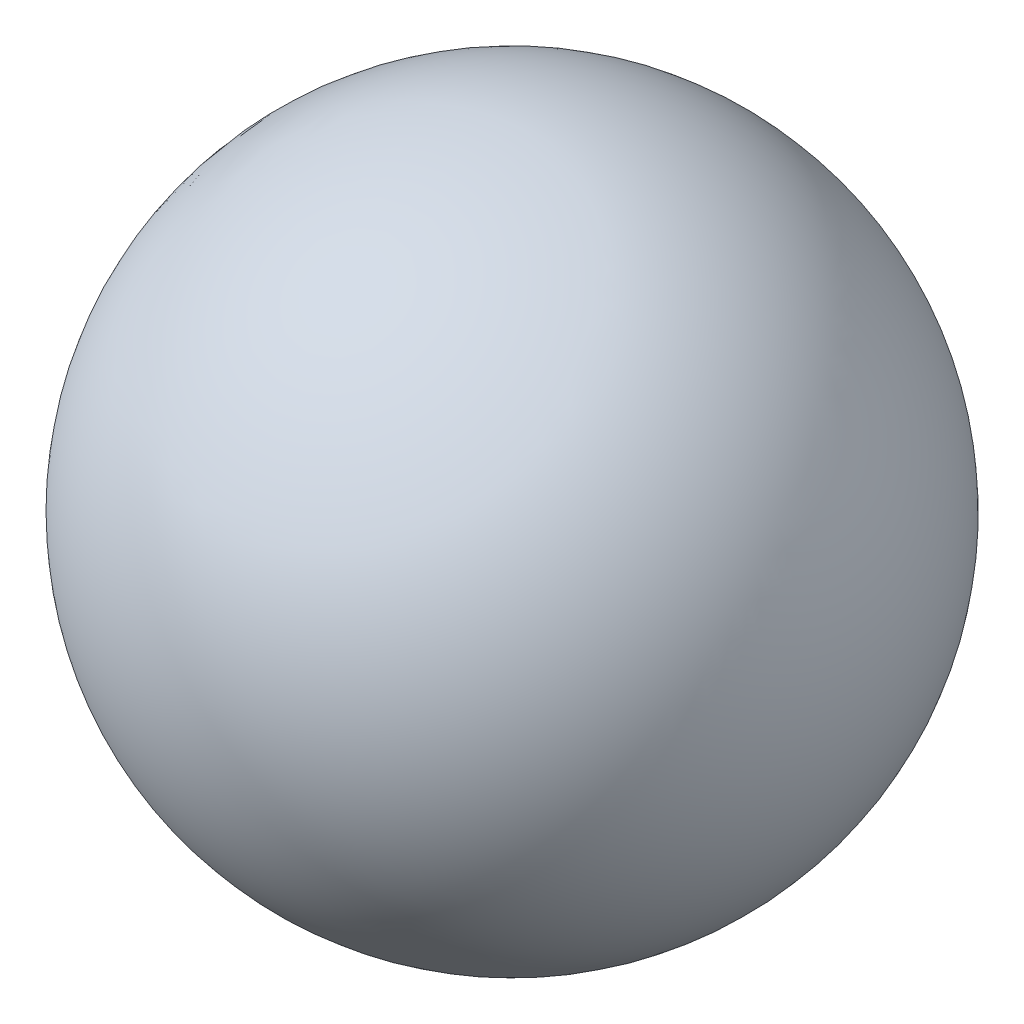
ISO-10303-21;
HEADER;
FILE_DESCRIPTION(('STEP AP214'),'2;1');
FILE_NAME('part.step','',(''),(''),'','','');
FILE_SCHEMA(('AUTOMOTIVE_DESIGN { 1 0 10303 214 1 1 1 1 }'));
ENDSEC;
DATA;
#1=APPLICATION_CONTEXT('core data for automotive mechanical design processes');
#2=APPLICATION_PROTOCOL_DEFINITION('international standard','automotive_design',2000,#1);
#3=PRODUCT_CONTEXT('',#1,'mechanical');
#4=PRODUCT('Part','Part','',(#3));
#5=PRODUCT_RELATED_PRODUCT_CATEGORY('part','',(#4));
#6=PRODUCT_DEFINITION_FORMATION('','',#4);
#7=PRODUCT_DEFINITION_CONTEXT('part definition',#1,'design');
#8=PRODUCT_DEFINITION('design','',#6,#7);
#9=PRODUCT_DEFINITION_SHAPE('','',#8);
#10=(LENGTH_UNIT() NAMED_UNIT(*) SI_UNIT(.MILLI.,.METRE.));
#11=(NAMED_UNIT(*) PLANE_ANGLE_UNIT() SI_UNIT($,.RADIAN.));
#12=(NAMED_UNIT(*) SI_UNIT($,.STERADIAN.) SOLID_ANGLE_UNIT());
#13=UNCERTAINTY_MEASURE_WITH_UNIT(LENGTH_MEASURE(1.E-05),#10,'distance_accuracy_value','');
#14=(GEOMETRIC_REPRESENTATION_CONTEXT(3) GLOBAL_UNCERTAINTY_ASSIGNED_CONTEXT((#13)) GLOBAL_UNIT_ASSIGNED_CONTEXT((#10,
#11,#12)) REPRESENTATION_CONTEXT('',''));
#15=CARTESIAN_POINT('',(0.,0.,0.));
#16=DIRECTION('',(0.,0.,1.));
#17=DIRECTION('',(1.,0.,0.));
#18=AXIS2_PLACEMENT_3D('',#15,#16,#17);
#19=CARTESIAN_POINT('',(7.,11.8440385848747,-11.8440385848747));
#20=DIRECTION('',(0.706669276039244,0.694471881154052,0.135378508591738));
#21=DIRECTION('',(-0.706273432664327,0.680906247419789,0.193764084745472));
#22=AXIS2_PLACEMENT_3D('',#19,#20,#21);
#23=SPHERICAL_SURFACE('',#22,4.05);
#24=CARTESIAN_POINT('',(4.13798943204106,9.03142746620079,-12.3923215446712));
#25=VERTEX_POINT('',#24);
#26=VERTEX_LOOP('',#25);
#27=FACE_BOUND('',#26,.T.);
#28=CARTESIAN_POINT('',(9.86201056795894,14.6566497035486,-11.2957556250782));
#29=VERTEX_POINT('',#28);
#30=VERTEX_LOOP('',#29);
#31=FACE_BOUND('',#30,.T.);
#32=ADVANCED_FACE('F16',(#27,#31),#23,.T.);
#33=CLOSED_SHELL('',(#32));
#34=MANIFOLD_SOLID_BREP('B1',#33);
#35=ADVANCED_BREP_SHAPE_REPRESENTATION('',(#18,#34),#14);
#36=SHAPE_DEFINITION_REPRESENTATION(#9,#35);
ENDSEC;
END-ISO-10303-21;
